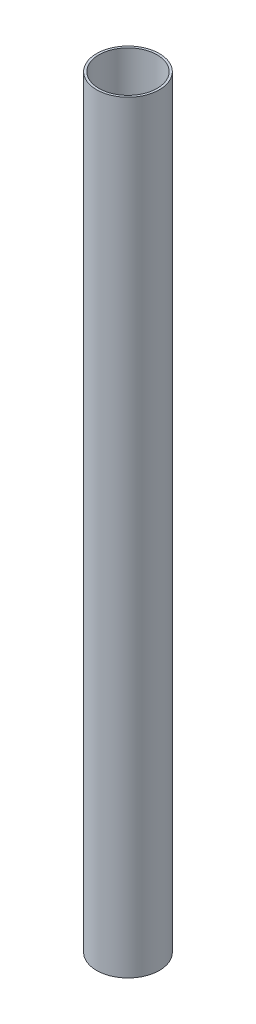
ISO-10303-21;
HEADER;
FILE_DESCRIPTION(('STEP AP214'),'2;1');
FILE_NAME('part.step','',(''),(''),'','','');
FILE_SCHEMA(('AUTOMOTIVE_DESIGN { 1 0 10303 214 1 1 1 1 }'));
ENDSEC;
DATA;
#1=APPLICATION_CONTEXT('core data for automotive mechanical design processes');
#2=APPLICATION_PROTOCOL_DEFINITION('international standard','automotive_design',2000,#1);
#3=PRODUCT_CONTEXT('',#1,'mechanical');
#4=PRODUCT('Part','Part','',(#3));
#5=PRODUCT_RELATED_PRODUCT_CATEGORY('part','',(#4));
#6=PRODUCT_DEFINITION_FORMATION('','',#4);
#7=PRODUCT_DEFINITION_CONTEXT('part definition',#1,'design');
#8=PRODUCT_DEFINITION('design','',#6,#7);
#9=PRODUCT_DEFINITION_SHAPE('','',#8);
#10=(LENGTH_UNIT() NAMED_UNIT(*) SI_UNIT(.MILLI.,.METRE.));
#11=(NAMED_UNIT(*) PLANE_ANGLE_UNIT() SI_UNIT($,.RADIAN.));
#12=(NAMED_UNIT(*) SI_UNIT($,.STERADIAN.) SOLID_ANGLE_UNIT());
#13=UNCERTAINTY_MEASURE_WITH_UNIT(LENGTH_MEASURE(1.E-05),#10,'distance_accuracy_value','');
#14=(GEOMETRIC_REPRESENTATION_CONTEXT(3) GLOBAL_UNCERTAINTY_ASSIGNED_CONTEXT((#13)) GLOBAL_UNIT_ASSIGNED_CONTEXT((#10,
#11,#12)) REPRESENTATION_CONTEXT('',''));
#15=CARTESIAN_POINT('',(0.,0.,0.));
#16=DIRECTION('',(0.,0.,1.));
#17=DIRECTION('',(1.,0.,0.));
#18=AXIS2_PLACEMENT_3D('',#15,#16,#17);
#19=CARTESIAN_POINT('',(0.,457.2,0.));
#20=DIRECTION('',(0.,1.,0.));
#21=DIRECTION('',(0.,0.,1.));
#22=AXIS2_PLACEMENT_3D('',#19,#20,#21);
#23=PLANE('',#22);
#24=CARTESIAN_POINT('',(0.,457.2,0.));
#25=DIRECTION('',(0.,1.,0.));
#26=DIRECTION('',(0.,0.,1.));
#27=AXIS2_PLACEMENT_3D('',#24,#25,#26);
#28=CIRCLE('',#27,18.8087);
#29=CARTESIAN_POINT('',(0.,457.2,18.8087));
#30=VERTEX_POINT('',#29);
#31=EDGE_CURVE('E10',#30,#30,#28,.T.);
#32=ORIENTED_EDGE('',*,*,#31,.T.);
#33=EDGE_LOOP('',(#32));
#34=FACE_BOUND('',#33,.T.);
#35=CARTESIAN_POINT('',(0.,457.2,0.));
#36=DIRECTION('',(0.,1.,0.));
#37=DIRECTION('',(0.,0.,1.));
#38=AXIS2_PLACEMENT_3D('',#35,#36,#37);
#39=CIRCLE('',#38,17.4625);
#40=CARTESIAN_POINT('',(0.,457.2,17.4625));
#41=VERTEX_POINT('',#40);
#42=EDGE_CURVE('E42',#41,#41,#39,.T.);
#43=ORIENTED_EDGE('',*,*,#42,.F.);
#44=EDGE_LOOP('',(#43));
#45=FACE_BOUND('',#44,.T.);
#46=ADVANCED_FACE('F31',(#34,#45),#23,.T.);
#47=CARTESIAN_POINT('',(0.,0.,0.));
#48=DIRECTION('',(0.,1.,0.));
#49=DIRECTION('',(0.,0.,1.));
#50=AXIS2_PLACEMENT_3D('',#47,#48,#49);
#51=PLANE('',#50);
#52=CARTESIAN_POINT('',(0.,0.,0.));
#53=DIRECTION('',(0.,1.,0.));
#54=DIRECTION('',(0.,0.,1.));
#55=AXIS2_PLACEMENT_3D('',#52,#53,#54);
#56=CIRCLE('',#55,18.8087);
#57=CARTESIAN_POINT('',(0.,0.,18.8087));
#58=VERTEX_POINT('',#57);
#59=EDGE_CURVE('E35',#58,#58,#56,.T.);
#60=ORIENTED_EDGE('',*,*,#59,.F.);
#61=EDGE_LOOP('',(#60));
#62=FACE_BOUND('',#61,.T.);
#63=CARTESIAN_POINT('',(0.,0.,0.));
#64=DIRECTION('',(0.,1.,0.));
#65=DIRECTION('',(0.,0.,1.));
#66=AXIS2_PLACEMENT_3D('',#63,#64,#65);
#67=CIRCLE('',#66,17.4625);
#68=CARTESIAN_POINT('',(0.,0.,17.4625));
#69=VERTEX_POINT('',#68);
#70=EDGE_CURVE('E44',#69,#69,#67,.T.);
#71=ORIENTED_EDGE('',*,*,#70,.T.);
#72=EDGE_LOOP('',(#71));
#73=FACE_BOUND('',#72,.T.);
#74=ADVANCED_FACE('F54',(#62,#73),#51,.F.);
#75=CARTESIAN_POINT('',(0.,457.2,0.));
#76=DIRECTION('',(0.,-1.,0.));
#77=DIRECTION('',(0.,0.,-1.));
#78=AXIS2_PLACEMENT_3D('',#75,#76,#77);
#79=CYLINDRICAL_SURFACE('',#78,18.8087);
#80=ORIENTED_EDGE('',*,*,#31,.F.);
#81=EDGE_LOOP('',(#80));
#82=FACE_BOUND('',#81,.T.);
#83=ORIENTED_EDGE('',*,*,#59,.T.);
#84=EDGE_LOOP('',(#83));
#85=FACE_BOUND('',#84,.T.);
#86=ADVANCED_FACE('F33',(#82,#85),#79,.T.);
#87=CARTESIAN_POINT('',(0.,457.2,0.));
#88=DIRECTION('',(0.,-1.,0.));
#89=DIRECTION('',(0.,0.,-1.));
#90=AXIS2_PLACEMENT_3D('',#87,#88,#89);
#91=CYLINDRICAL_SURFACE('',#90,17.4625);
#92=ORIENTED_EDGE('',*,*,#42,.T.);
#93=EDGE_LOOP('',(#92));
#94=FACE_BOUND('',#93,.T.);
#95=ORIENTED_EDGE('',*,*,#70,.F.);
#96=EDGE_LOOP('',(#95));
#97=FACE_BOUND('',#96,.T.);
#98=ADVANCED_FACE('F50',(#94,#97),#91,.F.);
#99=CLOSED_SHELL('',(#46,#74,#86,#98));
#100=MANIFOLD_SOLID_BREP('B2',#99);
#101=ADVANCED_BREP_SHAPE_REPRESENTATION('',(#18,#100),#14);
#102=SHAPE_DEFINITION_REPRESENTATION(#9,#101);
ENDSEC;
END-ISO-10303-21;
